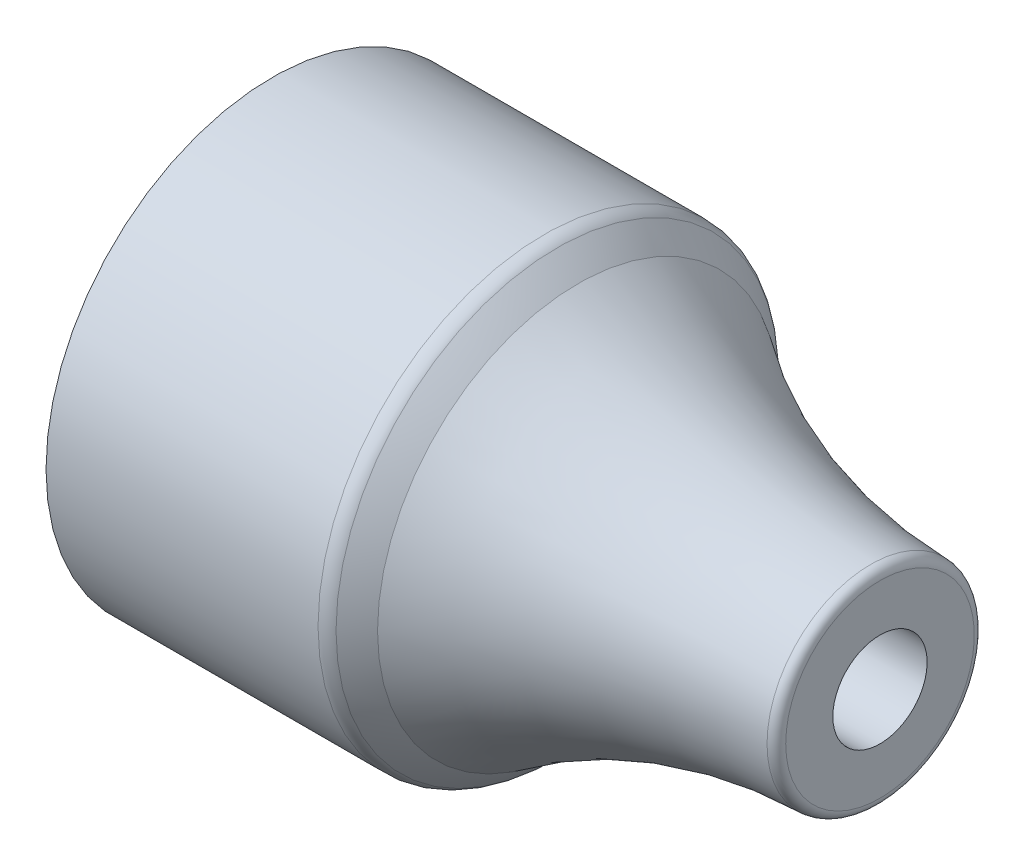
from build123d import *

# Parameters (mm, degrees)
SKETCH13_R      = 3
EXTRUDE12_DEPTH = 15
SKETCH14_R      = 4
SKETCH14_R_2    = 3
EXTRUDE13_DEPTH = 10


with BuildPart() as part:
    # Sketch2 → Revolve1 (revolve)
    with BuildSketch(Plane.XY, mode=Mode.PRIVATE) as revolve1_sk:
        with BuildLine():
            Line((10, 5), (10, 10.000159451))
            ThreePointArc((10, 10.000159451), (9.713392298, 10.70092434), (9.017857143, 11))
            ThreePointArc((9.017857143, 11), (-7.281408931, 13.776740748), (-22.01891344, 21.272227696))
            ThreePointArc((-22.01891344, 21.272227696), (-23.112932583, 22.38025241), (-24.235336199, 23.459514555))
            ThreePointArc((-24.235336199, 23.459514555), (-24.867571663, 23.859977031), (-25.602748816, 24))
            Line((-25.602748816, 24), (-54.45, 24))
            Line((-54.45, 24), (-54.45, 23.5))
            Line((-54.45, 23.5), (-51.45, 23.5))
            Line((-51.45, 23.5), (-51.45, 23))
            Line((-51.45, 23), (-26, 23))
            ThreePointArc((-26, 23), (-25.258401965, 22.857426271), (-24.622536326, 22.450032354))
            ThreePointArc((-24.622536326, 22.450032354), (-23.638214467, 21.492939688), (-22.676429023, 20.513202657))
            ThreePointArc((-22.676429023, 20.513202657), (-8.097029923, 12.995970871), (8.035087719, 10.02571293))
            ThreePointArc((8.035087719, 10.02571293), (8.719405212, 9.720919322), (9, 9.026328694))
            Line((9, 9.026328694), (9, 6))
            Line((9, 6), (-1, 6))
            Line((-1, 6), (-1, 0))
            Line((-1, 0), (0, 0))
            Line((0, 0), (0, 5))
            Line((0, 5), (10, 5))
        make_face()
    revolve(revolve1_sk.sketch.rotate(Axis((-71.774608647, 0, 0), (1, 0, 0)), 90), axis=Axis((-71.774608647, 0, 0), (1, 0, 0)))

    # Sketch13 → Extrude12 (cut)
    with BuildSketch(Plane(origin=(0, 0, 0), x_dir=(0, 0, -1), z_dir=(1, 0, 0))):
        Circle(SKETCH13_R)
    extrude(amount=-EXTRUDE12_DEPTH, mode=Mode.SUBTRACT)

    # Sketch14 → Extrude13 (add)
    with BuildSketch(Plane.ZY.offset(1)):
        with Locations(Location((0, 0, 0), (0, 0, 180))):
            Circle(SKETCH14_R)
        with Locations(Location((0, 0, 0), (0, 0, 180))):
            Circle(SKETCH14_R_2, mode=Mode.SUBTRACT)
    extrude(amount=EXTRUDE13_DEPTH)


solid = part.part
